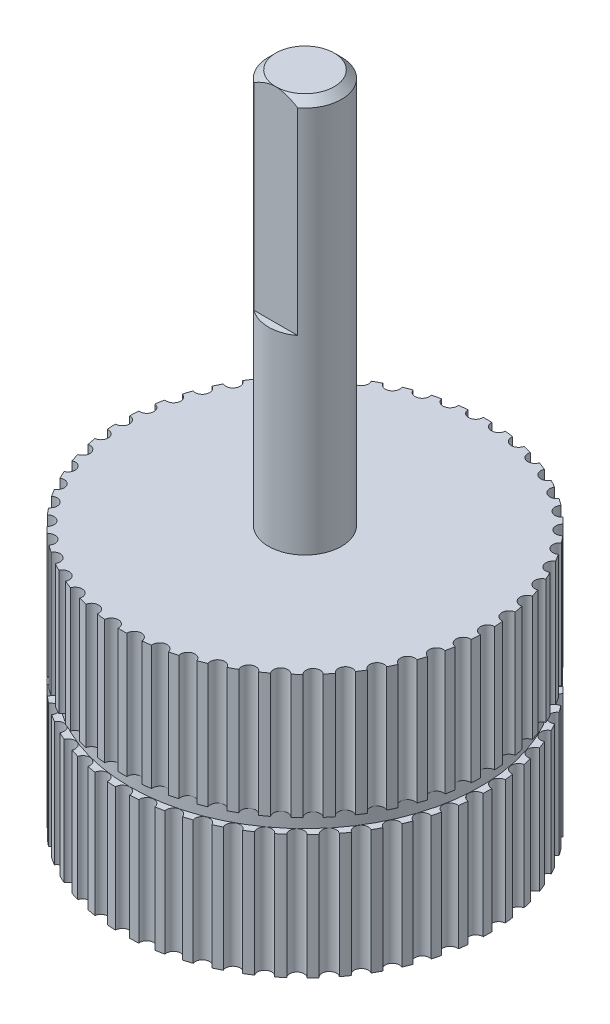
from build123d import *

# Parameters (mm, degrees)
SKETCH1_R             = 2.5
BOSS_EXTRUDE1_DEPTH   = 51
CHAMFER1_SIZE         = 0.5
CUT_EXTRUDE1_START    = -14
CUT_EXTRUDE1_DEPTH    = 14
BOSS_EXTRUDE2_START   = -6
BOSS_EXTRUDE2_DEPTH   = 8.5
SKETCH4_R             = 12
BOSS_EXTRUDE3_DEPTH   = 1
BOSS_EXTRUDE4_START   = -15.5
BOSS_EXTRUDE4_DEPTH   = 8.5
BODY_MOVE_COPY1_ANGLE = 3.6


with BuildPart() as part:
    # Sketch1 → Boss-Extrude1 (new body)
    with BuildSketch(Plane(origin=(0, 0, 0), x_dir=(1, 0, 0), z_dir=(0, 1, 0))):
        with Locations(Location((0, 0, 0), (0, 0, 270))):
            Circle(SKETCH1_R)
    extrude(amount=BOSS_EXTRUDE1_DEPTH)

    # Chamfer1
    chamfer1_edges = [part.edges().sort_by_distance(p)[0] for p in [
        (0, 0, -2.5),
        (0, 51, -2.5),
    ]]
    chamfer(chamfer1_edges, length=CHAMFER1_SIZE)

    # Sketch2 → Cut-Extrude1 (cut)
    with BuildSketch(Plane(origin=(0, 51, 0), x_dir=(1, 0, 0), z_dir=(0, 1, 0)).offset(CUT_EXTRUDE1_START)):
        with BuildLine():
            Line((-1.5, -2), (1.5, -2))
            ThreePointArc((1.5, -2), (0, -2.5), (-1.5, -2))
        make_face()
    extrude(amount=CUT_EXTRUDE1_DEPTH, mode=Mode.SUBTRACT)

    # Sketch3 → Boss-Extrude2 (add)
    with BuildSketch(Plane.XZ.offset(BOSS_EXTRUDE2_START)):
        with BuildLine():
            ThreePointArc((1.078579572, 12.453379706), (0.784881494, 12.475334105), (0.490747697, 12.490362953))
            ThreePointArc((0.490747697, 12.490362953), (0, 12.009157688), (-0.490747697, 12.490362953))
            ThreePointArc((-0.490747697, 12.490362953), (-0.784881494, 12.475334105), (-1.078579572, 12.453379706))
            ThreePointArc((-1.078579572, 12.453379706), (-1.505146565, 11.914461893), (-2.052335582, 12.330365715))
            ThreePointArc((-2.052335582, 12.330365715), (-2.342266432, 12.278590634), (-2.630896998, 12.219999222))
            ThreePointArc((-2.630896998, 12.219999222), (-2.98655607, 11.631867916), (-3.581556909, 11.975911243))
            ThreePointArc((-3.581556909, 11.975911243), (-3.86271243, 11.888206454), (-4.141723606, 11.79390205))
            ThreePointArc((-4.141723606, 11.79390205), (-4.420865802, 11.165832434), (-5.054294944, 11.432589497))
            ThreePointArc((-5.054294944, 11.432589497), (-5.322241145, 11.310338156), (-5.587232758, 11.181807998))
            ThreePointArc((-5.587232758, 11.181807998), (-5.785455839, 10.523705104), (-6.447323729, 10.708968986))
            ThreePointArc((-6.447323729, 10.708968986), (-6.697834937, 10.554099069), (-6.944627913, 10.393370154))
            ThreePointArc((-6.944627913, 10.393370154), (-7.058805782, 9.715612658), (-7.738674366, 9.816461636))
            ThreePointArc((-7.738674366, 9.816461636), (-7.967799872, 9.631415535), (-8.192502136, 9.441022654))
            ThreePointArc((-8.192502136, 9.441022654), (-8.22083414, 8.754299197), (-8.907981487, 8.769142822))
            ThreePointArc((-8.907981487, 8.769142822), (-9.112107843, 8.556838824), (-9.311175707, 8.339784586))
            ThreePointArc((-9.311175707, 8.339784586), (-9.253215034, 7.654925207), (-9.936804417, 7.583529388))
            ThreePointArc((-9.936804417, 7.583529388), (-10.11271243, 7.347315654), (-10.283006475, 7.107023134))
            ThreePointArc((-10.283006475, 7.107023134), (-10.139667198, 6.434828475), (-10.808918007, 6.278319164))
            ThreePointArc((-10.808918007, 6.278319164), (-10.953833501, 6.021920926), (-11.092668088, 5.762179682))
            ThreePointArc((-11.092668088, 5.762179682), (-10.866210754, 5.113250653), (-11.510568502, 4.874096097))
            ThreePointArc((-11.510568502, 4.874096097), (-11.622206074, 4.601556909), (-11.727391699, 4.326463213))
            ThreePointArc((-11.727391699, 4.326463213), (-11.421387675, 3.711033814), (-12.030690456, 3.393005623))
            ThreePointArc((-12.030690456, 3.393005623), (-12.107289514, 3.10862359), (-12.177167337, 2.822515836))
            ThreePointArc((-12.177167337, 2.822515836), (-11.796442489, 2.250291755), (-12.361081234, 1.858405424))
            ThreePointArc((-12.361081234, 1.858405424), (-12.401433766, 1.56666542), (-12.434901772, 1.274055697))
            ThreePointArc((-12.434901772, 1.274055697), (-11.985460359, 0.75406125), (-12.496530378, 0.29449706))
            ThreePointArc((-12.496530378, 0.29449706), (-12.5, 0), (-12.496530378, -0.29449706))
            ThreePointArc((-12.496530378, -0.29449706), (-11.985460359, -0.75406125), (-12.434901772, -1.274055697))
            ThreePointArc((-12.434901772, -1.274055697), (-12.401433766, -1.56666542), (-12.361081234, -1.858405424))
            ThreePointArc((-12.361081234, -1.858405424), (-11.796442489, -2.250291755), (-12.177167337, -2.822515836))
            ThreePointArc((-12.177167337, -2.822515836), (-12.107289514, -3.10862359), (-12.030690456, -3.393005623))
            ThreePointArc((-12.030690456, -3.393005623), (-11.421387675, -3.711033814), (-11.727391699, -4.326463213))
            ThreePointArc((-11.727391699, -4.326463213), (-11.622206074, -4.601556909), (-11.510568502, -4.874096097))
            ThreePointArc((-11.510568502, -4.874096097), (-10.866210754, -5.113250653), (-11.092668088, -5.762179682))
            ThreePointArc((-11.092668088, -5.762179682), (-10.953833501, -6.021920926), (-10.808918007, -6.278319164))
            ThreePointArc((-10.808918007, -6.278319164), (-10.139667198, -6.434828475), (-10.283006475, -7.107023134))
            ThreePointArc((-10.283006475, -7.107023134), (-10.11271243, -7.347315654), (-9.936804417, -7.583529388))
            ThreePointArc((-9.936804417, -7.583529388), (-9.253215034, -7.654925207), (-9.311175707, -8.339784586))
            ThreePointArc((-9.311175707, -8.339784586), (-9.112107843, -8.556838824), (-8.907981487, -8.769142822))
            ThreePointArc((-8.907981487, -8.769142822), (-8.22083414, -8.754299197), (-8.192502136, -9.441022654))
            ThreePointArc((-8.192502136, -9.441022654), (-7.967799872, -9.631415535), (-7.738674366, -9.816461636))
            ThreePointArc((-7.738674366, -9.816461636), (-7.058805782, -9.715612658), (-6.944627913, -10.393370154))
            ThreePointArc((-6.944627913, -10.393370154), (-6.697834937, -10.554099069), (-6.447323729, -10.708968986))
            ThreePointArc((-6.447323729, -10.708968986), (-5.785455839, -10.523705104), (-5.587232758, -11.181807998))
            ThreePointArc((-5.587232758, -11.181807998), (-5.322241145, -11.310338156), (-5.054294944, -11.432589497))
            ThreePointArc((-5.054294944, -11.432589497), (-4.420865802, -11.165832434), (-4.141723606, -11.79390205))
            ThreePointArc((-4.141723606, -11.79390205), (-3.86271243, -11.888206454), (-3.581556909, -11.975911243))
            ThreePointArc((-3.581556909, -11.975911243), (-2.98655607, -11.631867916), (-2.630896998, -12.219999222))
            ThreePointArc((-2.630896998, -12.219999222), (-2.342266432, -12.278590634), (-2.052335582, -12.330365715))
            ThreePointArc((-2.052335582, -12.330365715), (-1.505146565, -11.914461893), (-1.078579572, -12.453379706))
            ThreePointArc((-1.078579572, -12.453379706), (-0.784881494, -12.475334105), (-0.490747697, -12.490362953))
            ThreePointArc((-0.490747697, -12.490362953), (0, -12.009157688), (0.490747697, -12.490362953))
            ThreePointArc((0.490747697, -12.490362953), (0.784881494, -12.475334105), (1.078579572, -12.453379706))
            ThreePointArc((1.078579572, -12.453379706), (1.505146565, -11.914461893), (2.052335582, -12.330365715))
            ThreePointArc((2.052335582, -12.330365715), (2.342266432, -12.278590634), (2.630896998, -12.219999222))
            ThreePointArc((2.630896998, -12.219999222), (2.98655607, -11.631867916), (3.581556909, -11.975911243))
            ThreePointArc((3.581556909, -11.975911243), (3.86271243, -11.888206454), (4.141723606, -11.79390205))
            ThreePointArc((4.141723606, -11.79390205), (4.420865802, -11.165832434), (5.054294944, -11.432589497))
            ThreePointArc((5.054294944, -11.432589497), (5.322241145, -11.310338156), (5.587232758, -11.181807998))
            ThreePointArc((5.587232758, -11.181807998), (5.785455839, -10.523705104), (6.447323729, -10.708968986))
            ThreePointArc((6.447323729, -10.708968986), (6.697834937, -10.554099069), (6.944627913, -10.393370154))
            ThreePointArc((6.944627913, -10.393370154), (7.058805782, -9.715612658), (7.738674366, -9.816461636))
            ThreePointArc((7.738674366, -9.816461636), (7.967799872, -9.631415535), (8.192502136, -9.441022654))
            ThreePointArc((8.192502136, -9.441022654), (8.22083414, -8.754299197), (8.907981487, -8.769142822))
            ThreePointArc((8.907981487, -8.769142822), (9.112107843, -8.556838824), (9.311175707, -8.339784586))
            ThreePointArc((9.311175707, -8.339784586), (9.253215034, -7.654925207), (9.936804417, -7.583529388))
            ThreePointArc((9.936804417, -7.583529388), (10.11271243, -7.347315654), (10.283006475, -7.107023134))
            ThreePointArc((10.283006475, -7.107023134), (10.139667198, -6.434828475), (10.808918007, -6.278319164))
            ThreePointArc((10.808918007, -6.278319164), (10.953833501, -6.021920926), (11.092668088, -5.762179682))
            ThreePointArc((11.092668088, -5.762179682), (10.866210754, -5.113250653), (11.510568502, -4.874096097))
            ThreePointArc((11.510568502, -4.874096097), (11.622206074, -4.601556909), (11.727391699, -4.326463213))
            ThreePointArc((11.727391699, -4.326463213), (11.421387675, -3.711033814), (12.030690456, -3.393005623))
            ThreePointArc((12.030690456, -3.393005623), (12.107289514, -3.10862359), (12.177167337, -2.822515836))
            ThreePointArc((12.177167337, -2.822515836), (11.796442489, -2.250291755), (12.361081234, -1.858405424))
            ThreePointArc((12.361081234, -1.858405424), (12.401433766, -1.56666542), (12.434901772, -1.274055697))
            ThreePointArc((12.434901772, -1.274055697), (11.985460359, -0.75406125), (12.496530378, -0.29449706))
            ThreePointArc((12.496530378, -0.29449706), (12.5, 0), (12.496530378, 0.29449706))
            ThreePointArc((12.496530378, 0.29449706), (11.985460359, 0.75406125), (12.434901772, 1.274055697))
            ThreePointArc((12.434901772, 1.274055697), (12.401433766, 1.56666542), (12.361081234, 1.858405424))
            ThreePointArc((12.361081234, 1.858405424), (11.796442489, 2.250291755), (12.177167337, 2.822515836))
            ThreePointArc((12.177167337, 2.822515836), (12.107289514, 3.10862359), (12.030690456, 3.393005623))
            ThreePointArc((12.030690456, 3.393005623), (11.421387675, 3.711033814), (11.727391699, 4.326463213))
            ThreePointArc((11.727391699, 4.326463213), (11.622206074, 4.601556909), (11.510568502, 4.874096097))
            ThreePointArc((11.510568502, 4.874096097), (10.866210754, 5.113250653), (11.092668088, 5.762179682))
            ThreePointArc((11.092668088, 5.762179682), (10.953833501, 6.021920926), (10.808918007, 6.278319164))
            ThreePointArc((10.808918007, 6.278319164), (10.139667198, 6.434828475), (10.283006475, 7.107023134))
            ThreePointArc((10.283006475, 7.107023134), (10.11271243, 7.347315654), (9.936804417, 7.583529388))
            ThreePointArc((9.936804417, 7.583529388), (9.253215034, 7.654925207), (9.311175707, 8.339784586))
            ThreePointArc((9.311175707, 8.339784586), (9.112107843, 8.556838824), (8.907981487, 8.769142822))
            ThreePointArc((8.907981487, 8.769142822), (8.22083414, 8.754299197), (8.192502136, 9.441022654))
            ThreePointArc((8.192502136, 9.441022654), (7.967799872, 9.631415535), (7.738674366, 9.816461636))
            ThreePointArc((7.738674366, 9.816461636), (7.058805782, 9.715612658), (6.944627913, 10.393370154))
            ThreePointArc((6.944627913, 10.393370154), (6.697834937, 10.554099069), (6.447323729, 10.708968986))
            ThreePointArc((6.447323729, 10.708968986), (5.785455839, 10.523705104), (5.587232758, 11.181807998))
            ThreePointArc((5.587232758, 11.181807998), (5.322241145, 11.310338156), (5.054294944, 11.432589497))
            ThreePointArc((5.054294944, 11.432589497), (4.420865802, 11.165832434), (4.141723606, 11.79390205))
            ThreePointArc((4.141723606, 11.79390205), (3.86271243, 11.888206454), (3.581556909, 11.975911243))
            ThreePointArc((3.581556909, 11.975911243), (2.98655607, 11.631867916), (2.630896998, 12.219999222))
            ThreePointArc((2.630896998, 12.219999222), (2.342266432, 12.278590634), (2.052335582, 12.330365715))
            ThreePointArc((2.052335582, 12.330365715), (1.505146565, 11.914461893), (1.078579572, 12.453379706))
        make_face()
    extrude(amount=-BOSS_EXTRUDE2_DEPTH)

    # Sketch4 → Boss-Extrude3 (add)
    with BuildSketch(Plane(origin=(0, 14.5, 0), x_dir=(1, 0, 0), z_dir=(0, 1, 0))):
        with Locations(Location((0, 0, 0), (0, 0, 90))):
            Circle(SKETCH4_R)
    extrude(amount=BOSS_EXTRUDE3_DEPTH)


with BuildPart() as body_2:
    # Sketch3_2 → Boss-Extrude4 (new body)
    with BuildSketch(Plane.XZ.offset(BOSS_EXTRUDE4_START)):
        with BuildLine():
            ThreePointArc((1.078579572, 12.453379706), (0.784881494, 12.475334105), (0.490747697, 12.490362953))
            ThreePointArc((0.490747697, 12.490362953), (0, 12.009157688), (-0.490747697, 12.490362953))
            ThreePointArc((-0.490747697, 12.490362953), (-0.784881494, 12.475334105), (-1.078579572, 12.453379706))
            ThreePointArc((-1.078579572, 12.453379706), (-1.505146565, 11.914461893), (-2.052335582, 12.330365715))
            ThreePointArc((-2.052335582, 12.330365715), (-2.342266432, 12.278590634), (-2.630896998, 12.219999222))
            ThreePointArc((-2.630896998, 12.219999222), (-2.98655607, 11.631867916), (-3.581556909, 11.975911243))
            ThreePointArc((-3.581556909, 11.975911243), (-3.86271243, 11.888206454), (-4.141723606, 11.79390205))
            ThreePointArc((-4.141723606, 11.79390205), (-4.420865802, 11.165832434), (-5.054294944, 11.432589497))
            ThreePointArc((-5.054294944, 11.432589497), (-5.322241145, 11.310338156), (-5.587232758, 11.181807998))
            ThreePointArc((-5.587232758, 11.181807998), (-5.785455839, 10.523705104), (-6.447323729, 10.708968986))
            ThreePointArc((-6.447323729, 10.708968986), (-6.697834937, 10.554099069), (-6.944627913, 10.393370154))
            ThreePointArc((-6.944627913, 10.393370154), (-7.058805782, 9.715612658), (-7.738674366, 9.816461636))
            ThreePointArc((-7.738674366, 9.816461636), (-7.967799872, 9.631415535), (-8.192502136, 9.441022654))
            ThreePointArc((-8.192502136, 9.441022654), (-8.22083414, 8.754299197), (-8.907981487, 8.769142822))
            ThreePointArc((-8.907981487, 8.769142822), (-9.112107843, 8.556838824), (-9.311175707, 8.339784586))
            ThreePointArc((-9.311175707, 8.339784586), (-9.253215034, 7.654925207), (-9.936804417, 7.583529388))
            ThreePointArc((-9.936804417, 7.583529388), (-10.11271243, 7.347315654), (-10.283006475, 7.107023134))
            ThreePointArc((-10.283006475, 7.107023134), (-10.139667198, 6.434828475), (-10.808918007, 6.278319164))
            ThreePointArc((-10.808918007, 6.278319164), (-10.953833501, 6.021920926), (-11.092668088, 5.762179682))
            ThreePointArc((-11.092668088, 5.762179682), (-10.866210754, 5.113250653), (-11.510568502, 4.874096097))
            ThreePointArc((-11.510568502, 4.874096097), (-11.622206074, 4.601556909), (-11.727391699, 4.326463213))
            ThreePointArc((-11.727391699, 4.326463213), (-11.421387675, 3.711033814), (-12.030690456, 3.393005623))
            ThreePointArc((-12.030690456, 3.393005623), (-12.107289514, 3.10862359), (-12.177167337, 2.822515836))
            ThreePointArc((-12.177167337, 2.822515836), (-11.796442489, 2.250291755), (-12.361081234, 1.858405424))
            ThreePointArc((-12.361081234, 1.858405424), (-12.401433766, 1.56666542), (-12.434901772, 1.274055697))
            ThreePointArc((-12.434901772, 1.274055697), (-11.985460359, 0.75406125), (-12.496530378, 0.29449706))
            ThreePointArc((-12.496530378, 0.29449706), (-12.5, 0), (-12.496530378, -0.29449706))
            ThreePointArc((-12.496530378, -0.29449706), (-11.985460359, -0.75406125), (-12.434901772, -1.274055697))
            ThreePointArc((-12.434901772, -1.274055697), (-12.401433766, -1.56666542), (-12.361081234, -1.858405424))
            ThreePointArc((-12.361081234, -1.858405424), (-11.796442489, -2.250291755), (-12.177167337, -2.822515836))
            ThreePointArc((-12.177167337, -2.822515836), (-12.107289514, -3.10862359), (-12.030690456, -3.393005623))
            ThreePointArc((-12.030690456, -3.393005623), (-11.421387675, -3.711033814), (-11.727391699, -4.326463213))
            ThreePointArc((-11.727391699, -4.326463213), (-11.622206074, -4.601556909), (-11.510568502, -4.874096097))
            ThreePointArc((-11.510568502, -4.874096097), (-10.866210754, -5.113250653), (-11.092668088, -5.762179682))
            ThreePointArc((-11.092668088, -5.762179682), (-10.953833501, -6.021920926), (-10.808918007, -6.278319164))
            ThreePointArc((-10.808918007, -6.278319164), (-10.139667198, -6.434828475), (-10.283006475, -7.107023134))
            ThreePointArc((-10.283006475, -7.107023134), (-10.11271243, -7.347315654), (-9.936804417, -7.583529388))
            ThreePointArc((-9.936804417, -7.583529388), (-9.253215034, -7.654925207), (-9.311175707, -8.339784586))
            ThreePointArc((-9.311175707, -8.339784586), (-9.112107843, -8.556838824), (-8.907981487, -8.769142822))
            ThreePointArc((-8.907981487, -8.769142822), (-8.22083414, -8.754299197), (-8.192502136, -9.441022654))
            ThreePointArc((-8.192502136, -9.441022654), (-7.967799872, -9.631415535), (-7.738674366, -9.816461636))
            ThreePointArc((-7.738674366, -9.816461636), (-7.058805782, -9.715612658), (-6.944627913, -10.393370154))
            ThreePointArc((-6.944627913, -10.393370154), (-6.697834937, -10.554099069), (-6.447323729, -10.708968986))
            ThreePointArc((-6.447323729, -10.708968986), (-5.785455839, -10.523705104), (-5.587232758, -11.181807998))
            ThreePointArc((-5.587232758, -11.181807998), (-5.322241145, -11.310338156), (-5.054294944, -11.432589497))
            ThreePointArc((-5.054294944, -11.432589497), (-4.420865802, -11.165832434), (-4.141723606, -11.79390205))
            ThreePointArc((-4.141723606, -11.79390205), (-3.86271243, -11.888206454), (-3.581556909, -11.975911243))
            ThreePointArc((-3.581556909, -11.975911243), (-2.98655607, -11.631867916), (-2.630896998, -12.219999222))
            ThreePointArc((-2.630896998, -12.219999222), (-2.342266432, -12.278590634), (-2.052335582, -12.330365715))
            ThreePointArc((-2.052335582, -12.330365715), (-1.505146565, -11.914461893), (-1.078579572, -12.453379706))
            ThreePointArc((-1.078579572, -12.453379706), (-0.784881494, -12.475334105), (-0.490747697, -12.490362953))
            ThreePointArc((-0.490747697, -12.490362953), (0, -12.009157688), (0.490747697, -12.490362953))
            ThreePointArc((0.490747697, -12.490362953), (0.784881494, -12.475334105), (1.078579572, -12.453379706))
            ThreePointArc((1.078579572, -12.453379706), (1.505146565, -11.914461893), (2.052335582, -12.330365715))
            ThreePointArc((2.052335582, -12.330365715), (2.342266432, -12.278590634), (2.630896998, -12.219999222))
            ThreePointArc((2.630896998, -12.219999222), (2.98655607, -11.631867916), (3.581556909, -11.975911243))
            ThreePointArc((3.581556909, -11.975911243), (3.86271243, -11.888206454), (4.141723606, -11.79390205))
            ThreePointArc((4.141723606, -11.79390205), (4.420865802, -11.165832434), (5.054294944, -11.432589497))
            ThreePointArc((5.054294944, -11.432589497), (5.322241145, -11.310338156), (5.587232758, -11.181807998))
            ThreePointArc((5.587232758, -11.181807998), (5.785455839, -10.523705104), (6.447323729, -10.708968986))
            ThreePointArc((6.447323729, -10.708968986), (6.697834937, -10.554099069), (6.944627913, -10.393370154))
            ThreePointArc((6.944627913, -10.393370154), (7.058805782, -9.715612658), (7.738674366, -9.816461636))
            ThreePointArc((7.738674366, -9.816461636), (7.967799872, -9.631415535), (8.192502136, -9.441022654))
            ThreePointArc((8.192502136, -9.441022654), (8.22083414, -8.754299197), (8.907981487, -8.769142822))
            ThreePointArc((8.907981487, -8.769142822), (9.112107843, -8.556838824), (9.311175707, -8.339784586))
            ThreePointArc((9.311175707, -8.339784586), (9.253215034, -7.654925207), (9.936804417, -7.583529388))
            ThreePointArc((9.936804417, -7.583529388), (10.11271243, -7.347315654), (10.283006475, -7.107023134))
            ThreePointArc((10.283006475, -7.107023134), (10.139667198, -6.434828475), (10.808918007, -6.278319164))
            ThreePointArc((10.808918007, -6.278319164), (10.953833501, -6.021920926), (11.092668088, -5.762179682))
            ThreePointArc((11.092668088, -5.762179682), (10.866210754, -5.113250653), (11.510568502, -4.874096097))
            ThreePointArc((11.510568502, -4.874096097), (11.622206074, -4.601556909), (11.727391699, -4.326463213))
            ThreePointArc((11.727391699, -4.326463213), (11.421387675, -3.711033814), (12.030690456, -3.393005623))
            ThreePointArc((12.030690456, -3.393005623), (12.107289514, -3.10862359), (12.177167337, -2.822515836))
            ThreePointArc((12.177167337, -2.822515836), (11.796442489, -2.250291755), (12.361081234, -1.858405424))
            ThreePointArc((12.361081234, -1.858405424), (12.401433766, -1.56666542), (12.434901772, -1.274055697))
            ThreePointArc((12.434901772, -1.274055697), (11.985460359, -0.75406125), (12.496530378, -0.29449706))
            ThreePointArc((12.496530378, -0.29449706), (12.5, 0), (12.496530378, 0.29449706))
            ThreePointArc((12.496530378, 0.29449706), (11.985460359, 0.75406125), (12.434901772, 1.274055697))
            ThreePointArc((12.434901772, 1.274055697), (12.401433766, 1.56666542), (12.361081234, 1.858405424))
            ThreePointArc((12.361081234, 1.858405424), (11.796442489, 2.250291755), (12.177167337, 2.822515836))
            ThreePointArc((12.177167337, 2.822515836), (12.107289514, 3.10862359), (12.030690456, 3.393005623))
            ThreePointArc((12.030690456, 3.393005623), (11.421387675, 3.711033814), (11.727391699, 4.326463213))
            ThreePointArc((11.727391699, 4.326463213), (11.622206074, 4.601556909), (11.510568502, 4.874096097))
            ThreePointArc((11.510568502, 4.874096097), (10.866210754, 5.113250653), (11.092668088, 5.762179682))
            ThreePointArc((11.092668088, 5.762179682), (10.953833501, 6.021920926), (10.808918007, 6.278319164))
            ThreePointArc((10.808918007, 6.278319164), (10.139667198, 6.434828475), (10.283006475, 7.107023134))
            ThreePointArc((10.283006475, 7.107023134), (10.11271243, 7.347315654), (9.936804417, 7.583529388))
            ThreePointArc((9.936804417, 7.583529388), (9.253215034, 7.654925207), (9.311175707, 8.339784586))
            ThreePointArc((9.311175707, 8.339784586), (9.112107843, 8.556838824), (8.907981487, 8.769142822))
            ThreePointArc((8.907981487, 8.769142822), (8.22083414, 8.754299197), (8.192502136, 9.441022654))
            ThreePointArc((8.192502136, 9.441022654), (7.967799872, 9.631415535), (7.738674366, 9.816461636))
            ThreePointArc((7.738674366, 9.816461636), (7.058805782, 9.715612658), (6.944627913, 10.393370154))
            ThreePointArc((6.944627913, 10.393370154), (6.697834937, 10.554099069), (6.447323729, 10.708968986))
            ThreePointArc((6.447323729, 10.708968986), (5.785455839, 10.523705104), (5.587232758, 11.181807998))
            ThreePointArc((5.587232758, 11.181807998), (5.322241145, 11.310338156), (5.054294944, 11.432589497))
            ThreePointArc((5.054294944, 11.432589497), (4.420865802, 11.165832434), (4.141723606, 11.79390205))
            ThreePointArc((4.141723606, 11.79390205), (3.86271243, 11.888206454), (3.581556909, 11.975911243))
            ThreePointArc((3.581556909, 11.975911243), (2.98655607, 11.631867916), (2.630896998, 12.219999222))
            ThreePointArc((2.630896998, 12.219999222), (2.342266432, 12.278590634), (2.052335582, 12.330365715))
            ThreePointArc((2.052335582, 12.330365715), (1.505146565, 11.914461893), (1.078579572, 12.453379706))
        make_face()
    extrude(amount=-BOSS_EXTRUDE4_DEPTH)


with BuildPart() as body_2_1:
    # Body-Move_Copy1: moved
    add(body_2.part.rotate(Axis((0, 0, 0), (0, 1, 0)), BODY_MOVE_COPY1_ANGLE))


with BuildPart() as part_1:
    add(part.part)

    # Combine1: union body 2
    add(body_2_1.part)


solid = part_1.part
